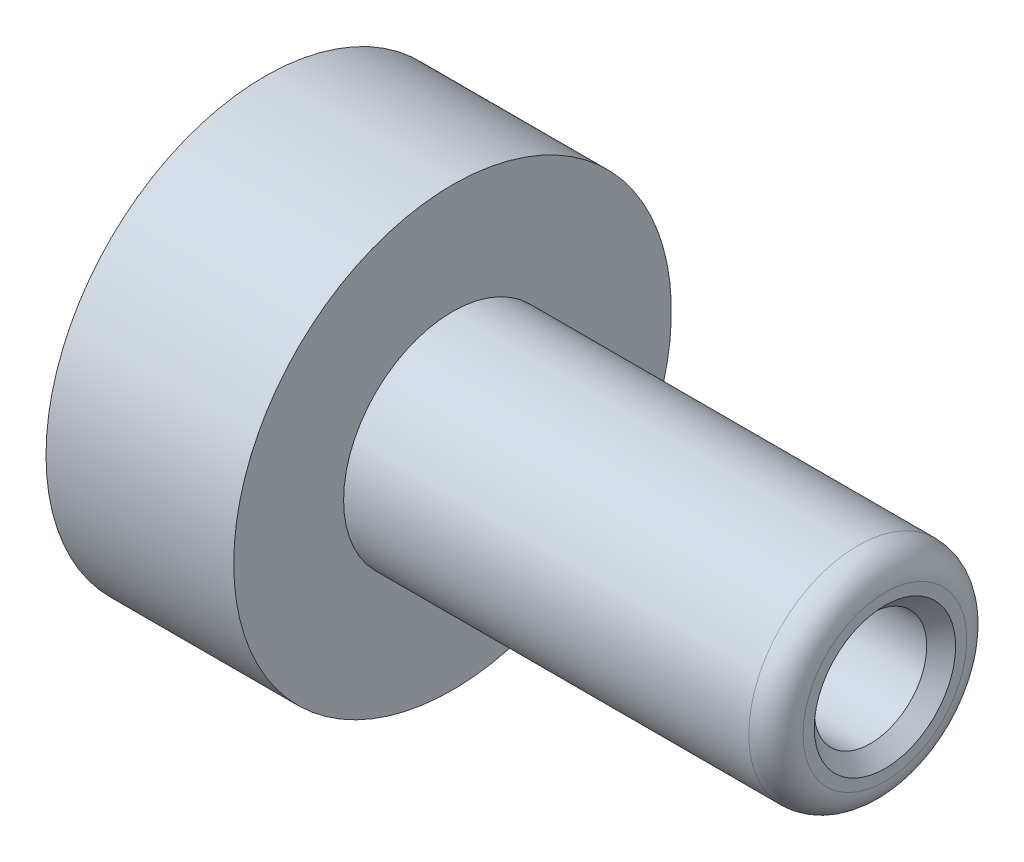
ISO-10303-21;
HEADER;
FILE_DESCRIPTION(('STEP AP214'),'2;1');
FILE_NAME('part.step','',(''),(''),'','','');
FILE_SCHEMA(('AUTOMOTIVE_DESIGN { 1 0 10303 214 1 1 1 1 }'));
ENDSEC;
DATA;
#1=APPLICATION_CONTEXT('core data for automotive mechanical design processes');
#2=APPLICATION_PROTOCOL_DEFINITION('international standard','automotive_design',2000,#1);
#3=PRODUCT_CONTEXT('',#1,'mechanical');
#4=PRODUCT('Part','Part','',(#3));
#5=PRODUCT_RELATED_PRODUCT_CATEGORY('part','',(#4));
#6=PRODUCT_DEFINITION_FORMATION('','',#4);
#7=PRODUCT_DEFINITION_CONTEXT('part definition',#1,'design');
#8=PRODUCT_DEFINITION('design','',#6,#7);
#9=PRODUCT_DEFINITION_SHAPE('','',#8);
#10=(LENGTH_UNIT() NAMED_UNIT(*) SI_UNIT(.MILLI.,.METRE.));
#11=(NAMED_UNIT(*) PLANE_ANGLE_UNIT() SI_UNIT($,.RADIAN.));
#12=(NAMED_UNIT(*) SI_UNIT($,.STERADIAN.) SOLID_ANGLE_UNIT());
#13=UNCERTAINTY_MEASURE_WITH_UNIT(LENGTH_MEASURE(1.E-05),#10,'distance_accuracy_value','');
#14=(GEOMETRIC_REPRESENTATION_CONTEXT(3) GLOBAL_UNCERTAINTY_ASSIGNED_CONTEXT((#13)) GLOBAL_UNIT_ASSIGNED_CONTEXT((#10,
#11,#12)) REPRESENTATION_CONTEXT('',''));
#15=CARTESIAN_POINT('',(0.,0.,0.));
#16=DIRECTION('',(0.,0.,1.));
#17=DIRECTION('',(1.,0.,0.));
#18=AXIS2_PLACEMENT_3D('',#15,#16,#17);
#19=CARTESIAN_POINT('',(0.,0.,0.));
#20=DIRECTION('',(-1.,0.,0.));
#21=DIRECTION('',(0.,0.,1.));
#22=AXIS2_PLACEMENT_3D('',#19,#20,#21);
#23=CYLINDRICAL_SURFACE('',#22,3.9751);
#24=CARTESIAN_POINT('',(21.8948,0.,0.));
#25=DIRECTION('',(-1.,0.,0.));
#26=DIRECTION('',(0.,0.,1.));
#27=AXIS2_PLACEMENT_3D('',#24,#25,#26);
#28=CIRCLE('',#27,3.9751);
#29=CARTESIAN_POINT('',(21.8948,0.,3.9751));
#30=VERTEX_POINT('',#29);
#31=EDGE_CURVE('E42',#30,#30,#28,.T.);
#32=ORIENTED_EDGE('',*,*,#31,.F.);
#33=EDGE_LOOP('',(#32));
#34=FACE_BOUND('',#33,.T.);
#35=CARTESIAN_POINT('',(0.,0.,0.));
#36=DIRECTION('',(-1.,0.,0.));
#37=DIRECTION('',(0.,0.,1.));
#38=AXIS2_PLACEMENT_3D('',#35,#36,#37);
#39=CIRCLE('',#38,3.9751);
#40=CARTESIAN_POINT('',(0.,0.,3.9751));
#41=VERTEX_POINT('',#40);
#42=EDGE_CURVE('E63',#41,#41,#39,.T.);
#43=ORIENTED_EDGE('',*,*,#42,.T.);
#44=EDGE_LOOP('',(#43));
#45=FACE_BOUND('',#44,.T.);
#46=ADVANCED_FACE('F31',(#34,#45),#23,.F.);
#47=CARTESIAN_POINT('',(21.8948,3.9751,0.));
#48=DIRECTION('',(1.,0.,0.));
#49=DIRECTION('',(0.,0.,-1.));
#50=AXIS2_PLACEMENT_3D('',#47,#48,#49);
#51=PLANE('',#50);
#52=CARTESIAN_POINT('',(21.8948,0.,0.));
#53=DIRECTION('',(1.,0.,0.));
#54=DIRECTION('',(0.,0.,-1.));
#55=AXIS2_PLACEMENT_3D('',#52,#53,#54);
#56=CIRCLE('',#55,3.2639);
#57=CARTESIAN_POINT('',(21.8948,0.,-3.2639));
#58=VERTEX_POINT('',#57);
#59=EDGE_CURVE('E76',#58,#58,#56,.T.);
#60=ORIENTED_EDGE('',*,*,#59,.T.);
#61=EDGE_LOOP('',(#60));
#62=FACE_BOUND('',#61,.T.);
#63=ORIENTED_EDGE('',*,*,#31,.T.);
#64=EDGE_LOOP('',(#63));
#65=FACE_BOUND('',#64,.T.);
#66=ADVANCED_FACE('F82',(#62,#65),#51,.F.);
#67=CARTESIAN_POINT('',(35.9918,4.7498,0.));
#68=DIRECTION('',(-1.,0.,0.));
#69=DIRECTION('',(0.,0.,1.));
#70=AXIS2_PLACEMENT_3D('',#67,#68,#69);
#71=PLANE('',#70);
#72=CARTESIAN_POINT('',(35.9918,0.,0.));
#73=DIRECTION('',(-1.,0.,0.));
#74=DIRECTION('',(0.,0.,1.));
#75=AXIS2_PLACEMENT_3D('',#72,#73,#74);
#76=CIRCLE('',#75,4.1021);
#77=CARTESIAN_POINT('',(35.9918,0.,4.1021));
#78=VERTEX_POINT('',#77);
#79=EDGE_CURVE('E10',#78,#78,#76,.T.);
#80=ORIENTED_EDGE('',*,*,#79,.T.);
#81=EDGE_LOOP('',(#80));
#82=FACE_BOUND('',#81,.T.);
#83=CARTESIAN_POINT('',(35.9918,0.,0.));
#84=DIRECTION('',(-1.,0.,0.));
#85=DIRECTION('',(0.,0.,1.));
#86=AXIS2_PLACEMENT_3D('',#83,#84,#85);
#87=CIRCLE('',#86,4.7498);
#88=CARTESIAN_POINT('',(35.9918,0.,4.7498));
#89=VERTEX_POINT('',#88);
#90=EDGE_CURVE('E46',#89,#89,#87,.T.);
#91=ORIENTED_EDGE('',*,*,#90,.F.);
#92=EDGE_LOOP('',(#91));
#93=FACE_BOUND('',#92,.T.);
#94=ADVANCED_FACE('F102',(#82,#93),#71,.F.);
#95=CARTESIAN_POINT('',(34.417,0.,0.));
#96=DIRECTION('',(-1.,0.,0.));
#97=DIRECTION('',(0.,0.,1.));
#98=AXIS2_PLACEMENT_3D('',#95,#96,#97);
#99=TOROIDAL_SURFACE('',#98,4.7498,1.5748);
#100=CARTESIAN_POINT('',(34.417,0.,0.));
#101=DIRECTION('',(-1.,0.,0.));
#102=DIRECTION('',(0.,0.,1.));
#103=AXIS2_PLACEMENT_3D('',#100,#101,#102);
#104=CIRCLE('',#103,6.3246);
#105=CARTESIAN_POINT('',(34.417,0.,6.3246));
#106=VERTEX_POINT('',#105);
#107=EDGE_CURVE('E51',#106,#106,#104,.T.);
#108=ORIENTED_EDGE('',*,*,#107,.F.);
#109=EDGE_LOOP('',(#108));
#110=FACE_BOUND('',#109,.T.);
#111=ORIENTED_EDGE('',*,*,#90,.T.);
#112=EDGE_LOOP('',(#111));
#113=FACE_BOUND('',#112,.T.);
#114=ADVANCED_FACE('F109',(#110,#113),#99,.T.);
#115=CARTESIAN_POINT('',(0.,0.,0.));
#116=DIRECTION('',(-1.,0.,0.));
#117=DIRECTION('',(0.,0.,1.));
#118=AXIS2_PLACEMENT_3D('',#115,#116,#117);
#119=CYLINDRICAL_SURFACE('',#118,6.3246);
#120=CARTESIAN_POINT('',(10.8966,0.,0.));
#121=DIRECTION('',(-1.,0.,0.));
#122=DIRECTION('',(0.,0.,1.));
#123=AXIS2_PLACEMENT_3D('',#120,#121,#122);
#124=CIRCLE('',#123,6.3246);
#125=CARTESIAN_POINT('',(10.8966,0.,6.3246));
#126=VERTEX_POINT('',#125);
#127=EDGE_CURVE('E54',#126,#126,#124,.T.);
#128=ORIENTED_EDGE('',*,*,#127,.F.);
#129=EDGE_LOOP('',(#128));
#130=FACE_BOUND('',#129,.T.);
#131=ORIENTED_EDGE('',*,*,#107,.T.);
#132=EDGE_LOOP('',(#131));
#133=FACE_BOUND('',#132,.T.);
#134=ADVANCED_FACE('F112',(#130,#133),#119,.T.);
#135=CARTESIAN_POINT('',(10.8966,12.7,0.));
#136=DIRECTION('',(-1.,0.,0.));
#137=DIRECTION('',(0.,0.,1.));
#138=AXIS2_PLACEMENT_3D('',#135,#136,#137);
#139=PLANE('',#138);
#140=CARTESIAN_POINT('',(10.8966,0.,0.));
#141=DIRECTION('',(-1.,0.,0.));
#142=DIRECTION('',(0.,0.,1.));
#143=AXIS2_PLACEMENT_3D('',#140,#141,#142);
#144=CIRCLE('',#143,12.7);
#145=CARTESIAN_POINT('',(10.8966,0.,12.7));
#146=VERTEX_POINT('',#145);
#147=EDGE_CURVE('E57',#146,#146,#144,.T.);
#148=ORIENTED_EDGE('',*,*,#147,.F.);
#149=EDGE_LOOP('',(#148));
#150=FACE_BOUND('',#149,.T.);
#151=ORIENTED_EDGE('',*,*,#127,.T.);
#152=EDGE_LOOP('',(#151));
#153=FACE_BOUND('',#152,.T.);
#154=ADVANCED_FACE('F116',(#150,#153),#139,.F.);
#155=CARTESIAN_POINT('',(0.,0.,0.));
#156=DIRECTION('',(-1.,0.,0.));
#157=DIRECTION('',(0.,0.,1.));
#158=AXIS2_PLACEMENT_3D('',#155,#156,#157);
#159=CYLINDRICAL_SURFACE('',#158,12.7);
#160=CARTESIAN_POINT('',(0.,0.,0.));
#161=DIRECTION('',(-1.,0.,0.));
#162=DIRECTION('',(0.,0.,1.));
#163=AXIS2_PLACEMENT_3D('',#160,#161,#162);
#164=CIRCLE('',#163,12.7);
#165=CARTESIAN_POINT('',(0.,0.,12.7));
#166=VERTEX_POINT('',#165);
#167=EDGE_CURVE('E60',#166,#166,#164,.T.);
#168=ORIENTED_EDGE('',*,*,#167,.F.);
#169=EDGE_LOOP('',(#168));
#170=FACE_BOUND('',#169,.T.);
#171=ORIENTED_EDGE('',*,*,#147,.T.);
#172=EDGE_LOOP('',(#171));
#173=FACE_BOUND('',#172,.T.);
#174=ADVANCED_FACE('F120',(#170,#173),#159,.T.);
#175=CARTESIAN_POINT('',(0.,3.9751,0.));
#176=DIRECTION('',(1.,0.,0.));
#177=DIRECTION('',(0.,0.,-1.));
#178=AXIS2_PLACEMENT_3D('',#175,#176,#177);
#179=PLANE('',#178);
#180=CARTESIAN_POINT('',(0.,0.,7.1374));
#181=DIRECTION('',(-1.,0.,0.));
#182=DIRECTION('',(0.,0.,-1.));
#183=AXIS2_PLACEMENT_3D('',#180,#181,#182);
#184=CIRCLE('',#183,1.6129);
#185=CARTESIAN_POINT('',(0.,0.,5.5245));
#186=VERTEX_POINT('',#185);
#187=EDGE_CURVE('E73',#186,#186,#184,.T.);
#188=ORIENTED_EDGE('',*,*,#187,.F.);
#189=EDGE_LOOP('',(#188));
#190=FACE_BOUND('',#189,.T.);
#191=CARTESIAN_POINT('',(0.,0.,-7.1374));
#192=DIRECTION('',(-1.,0.,0.));
#193=DIRECTION('',(0.,0.,1.));
#194=AXIS2_PLACEMENT_3D('',#191,#192,#193);
#195=CIRCLE('',#194,1.6129);
#196=CARTESIAN_POINT('',(0.,0.,-5.5245));
#197=VERTEX_POINT('',#196);
#198=EDGE_CURVE('E67',#197,#197,#195,.T.);
#199=ORIENTED_EDGE('',*,*,#198,.F.);
#200=EDGE_LOOP('',(#199));
#201=FACE_BOUND('',#200,.T.);
#202=ORIENTED_EDGE('',*,*,#42,.F.);
#203=EDGE_LOOP('',(#202));
#204=FACE_BOUND('',#203,.T.);
#205=ORIENTED_EDGE('',*,*,#167,.T.);
#206=EDGE_LOOP('',(#205));
#207=FACE_BOUND('',#206,.T.);
#208=ADVANCED_FACE('F124',(#190,#201,#204,#207),#179,.F.);
#209=CARTESIAN_POINT('',(6.35,0.,-7.1374));
#210=DIRECTION('',(-1.,0.,0.));
#211=DIRECTION('',(0.,0.,1.));
#212=AXIS2_PLACEMENT_3D('',#209,#210,#211);
#213=CYLINDRICAL_SURFACE('',#212,1.6129);
#214=CARTESIAN_POINT('',(6.35,0.,-7.1374));
#215=DIRECTION('',(-1.,0.,0.));
#216=DIRECTION('',(0.,0.,1.));
#217=AXIS2_PLACEMENT_3D('',#214,#215,#216);
#218=CIRCLE('',#217,1.6129);
#219=CARTESIAN_POINT('',(6.35,0.,-5.5245));
#220=VERTEX_POINT('',#219);
#221=EDGE_CURVE('E66',#220,#220,#218,.T.);
#222=ORIENTED_EDGE('',*,*,#221,.F.);
#223=EDGE_LOOP('',(#222));
#224=FACE_BOUND('',#223,.T.);
#225=ORIENTED_EDGE('',*,*,#198,.T.);
#226=EDGE_LOOP('',(#225));
#227=FACE_BOUND('',#226,.T.);
#228=ADVANCED_FACE('F128',(#224,#227),#213,.F.);
#229=CARTESIAN_POINT('',(6.35,0.,-7.1374));
#230=DIRECTION('',(-1.,0.,0.));
#231=DIRECTION('',(0.,0.,1.));
#232=AXIS2_PLACEMENT_3D('',#229,#230,#231);
#233=PLANE('',#232);
#234=ORIENTED_EDGE('',*,*,#221,.T.);
#235=EDGE_LOOP('',(#234));
#236=FACE_BOUND('',#235,.T.);
#237=ADVANCED_FACE('F132',(#236),#233,.T.);
#238=CARTESIAN_POINT('',(6.35,0.,7.1374));
#239=DIRECTION('',(-1.,0.,0.));
#240=DIRECTION('',(0.,0.,1.));
#241=AXIS2_PLACEMENT_3D('',#238,#239,#240);
#242=CYLINDRICAL_SURFACE('',#241,1.6129);
#243=CARTESIAN_POINT('',(6.35,0.,7.1374));
#244=DIRECTION('',(-1.,0.,0.));
#245=DIRECTION('',(0.,0.,-1.));
#246=AXIS2_PLACEMENT_3D('',#243,#244,#245);
#247=CIRCLE('',#246,1.6129);
#248=CARTESIAN_POINT('',(6.35,0.,5.5245));
#249=VERTEX_POINT('',#248);
#250=EDGE_CURVE('E70',#249,#249,#247,.T.);
#251=ORIENTED_EDGE('',*,*,#250,.F.);
#252=EDGE_LOOP('',(#251));
#253=FACE_BOUND('',#252,.T.);
#254=ORIENTED_EDGE('',*,*,#187,.T.);
#255=EDGE_LOOP('',(#254));
#256=FACE_BOUND('',#255,.T.);
#257=ADVANCED_FACE('F94',(#253,#256),#242,.F.);
#258=CARTESIAN_POINT('',(6.35,0.,7.1374));
#259=DIRECTION('',(1.,0.,0.));
#260=DIRECTION('',(0.,0.,-1.));
#261=AXIS2_PLACEMENT_3D('',#258,#259,#260);
#262=PLANE('',#261);
#263=ORIENTED_EDGE('',*,*,#250,.T.);
#264=EDGE_LOOP('',(#263));
#265=FACE_BOUND('',#264,.T.);
#266=ADVANCED_FACE('F87',(#265),#262,.F.);
#267=CARTESIAN_POINT('',(0.,0.,0.));
#268=DIRECTION('',(1.,0.,0.));
#269=DIRECTION('',(0.,0.,-1.));
#270=AXIS2_PLACEMENT_3D('',#267,#268,#269);
#271=CYLINDRICAL_SURFACE('',#270,3.2639);
#272=CARTESIAN_POINT('',(35.1536,0.,0.));
#273=DIRECTION('',(-1.,0.,0.));
#274=DIRECTION('',(0.,0.,1.));
#275=AXIS2_PLACEMENT_3D('',#272,#273,#274);
#276=CIRCLE('',#275,3.2639);
#277=CARTESIAN_POINT('',(35.1536,0.,3.2639));
#278=VERTEX_POINT('',#277);
#279=EDGE_CURVE('E38',#278,#278,#276,.F.);
#280=ORIENTED_EDGE('',*,*,#279,.T.);
#281=EDGE_LOOP('',(#280));
#282=FACE_BOUND('',#281,.T.);
#283=ORIENTED_EDGE('',*,*,#59,.F.);
#284=EDGE_LOOP('',(#283));
#285=FACE_BOUND('',#284,.T.);
#286=ADVANCED_FACE('F85',(#282,#285),#271,.F.);
#287=CARTESIAN_POINT('',(35.1536,0.,0.));
#288=DIRECTION('',(1.,0.,0.));
#289=DIRECTION('',(0.,0.,-1.));
#290=AXIS2_PLACEMENT_3D('',#287,#288,#289);
#291=CONICAL_SURFACE('',#290,3.2639,0.785398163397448);
#292=ORIENTED_EDGE('',*,*,#79,.F.);
#293=EDGE_LOOP('',(#292));
#294=FACE_BOUND('',#293,.T.);
#295=ORIENTED_EDGE('',*,*,#279,.F.);
#296=EDGE_LOOP('',(#295));
#297=FACE_BOUND('',#296,.T.);
#298=ADVANCED_FACE('F33',(#294,#297),#291,.F.);
#299=CLOSED_SHELL('',(#46,#66,#94,#114,#134,#154,#174,#208,#228,#237,#257,#266,#286,#298));
#300=MANIFOLD_SOLID_BREP('B2',#299);
#301=ADVANCED_BREP_SHAPE_REPRESENTATION('',(#18,#300),#14);
#302=SHAPE_DEFINITION_REPRESENTATION(#9,#301);
ENDSEC;
END-ISO-10303-21;
